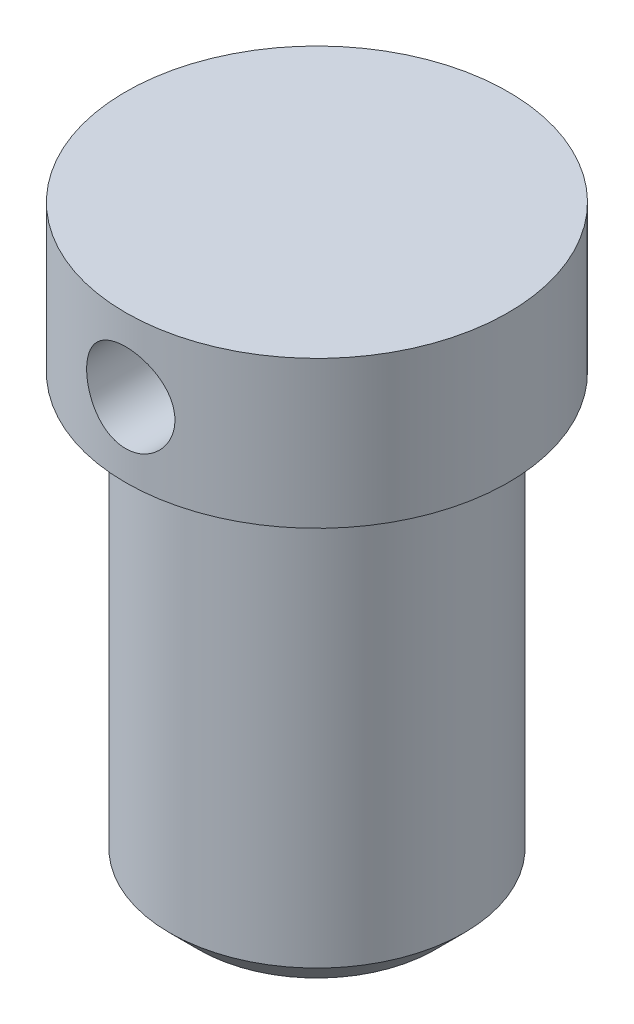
ISO-10303-21;
HEADER;
FILE_DESCRIPTION(('STEP AP214'),'2;1');
FILE_NAME('part.step','',(''),(''),'','','');
FILE_SCHEMA(('AUTOMOTIVE_DESIGN { 1 0 10303 214 1 1 1 1 }'));
ENDSEC;
DATA;
#1=APPLICATION_CONTEXT('core data for automotive mechanical design processes');
#2=APPLICATION_PROTOCOL_DEFINITION('international standard','automotive_design',2000,#1);
#3=PRODUCT_CONTEXT('',#1,'mechanical');
#4=PRODUCT('Part','Part','',(#3));
#5=PRODUCT_RELATED_PRODUCT_CATEGORY('part','',(#4));
#6=PRODUCT_DEFINITION_FORMATION('','',#4);
#7=PRODUCT_DEFINITION_CONTEXT('part definition',#1,'design');
#8=PRODUCT_DEFINITION('design','',#6,#7);
#9=PRODUCT_DEFINITION_SHAPE('','',#8);
#10=(LENGTH_UNIT() NAMED_UNIT(*) SI_UNIT(.MILLI.,.METRE.));
#11=(NAMED_UNIT(*) PLANE_ANGLE_UNIT() SI_UNIT($,.RADIAN.));
#12=(NAMED_UNIT(*) SI_UNIT($,.STERADIAN.) SOLID_ANGLE_UNIT());
#13=UNCERTAINTY_MEASURE_WITH_UNIT(LENGTH_MEASURE(1.E-05),#10,'distance_accuracy_value','');
#14=(GEOMETRIC_REPRESENTATION_CONTEXT(3) GLOBAL_UNCERTAINTY_ASSIGNED_CONTEXT((#13)) GLOBAL_UNIT_ASSIGNED_CONTEXT((#10,
#11,#12)) REPRESENTATION_CONTEXT('',''));
#15=CARTESIAN_POINT('',(0.,0.,0.));
#16=DIRECTION('',(0.,0.,1.));
#17=DIRECTION('',(1.,0.,0.));
#18=AXIS2_PLACEMENT_3D('',#15,#16,#17);
#19=CARTESIAN_POINT('',(0.,20.,0.));
#20=DIRECTION('',(0.,-1.,0.));
#21=DIRECTION('',(0.,0.,-1.));
#22=AXIS2_PLACEMENT_3D('',#19,#20,#21);
#23=CYLINDRICAL_SURFACE('',#22,6.5);
#24=CARTESIAN_POINT('',(0.,20.,0.));
#25=DIRECTION('',(0.,1.,0.));
#26=DIRECTION('',(0.,0.,1.));
#27=AXIS2_PLACEMENT_3D('',#24,#25,#26);
#28=CIRCLE('',#27,6.5);
#29=CARTESIAN_POINT('',(0.,20.,6.5));
#30=VERTEX_POINT('',#29);
#31=EDGE_CURVE('E48',#30,#30,#28,.T.);
#32=ORIENTED_EDGE('',*,*,#31,.F.);
#33=EDGE_LOOP('',(#32));
#34=FACE_BOUND('',#33,.T.);
#35=CARTESIAN_POINT('',(0.,15.,0.));
#36=DIRECTION('',(0.,1.,0.));
#37=DIRECTION('',(0.,0.,1.));
#38=AXIS2_PLACEMENT_3D('',#35,#36,#37);
#39=CIRCLE('',#38,6.5);
#40=CARTESIAN_POINT('',(0.,15.,6.5));
#41=VERTEX_POINT('',#40);
#42=EDGE_CURVE('E58',#41,#41,#39,.T.);
#43=ORIENTED_EDGE('',*,*,#42,.T.);
#44=EDGE_LOOP('',(#43));
#45=FACE_BOUND('',#44,.T.);
#46=CARTESIAN_POINT('',(-1.5,17.5,6.32455532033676));
#47=CARTESIAN_POINT('',(-1.49999731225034,17.4169570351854,6.3245569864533));
#48=CARTESIAN_POINT('',(-1.49308039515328,17.3338827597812,6.32620871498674));
#49=CARTESIAN_POINT('',(-1.46563082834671,17.1701052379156,6.33262329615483));
#50=CARTESIAN_POINT('',(-1.44508905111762,17.0894036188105,6.33738823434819));
#51=CARTESIAN_POINT('',(-1.39107808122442,16.9327640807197,6.34946149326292));
#52=CARTESIAN_POINT('',(-1.3576239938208,16.8568207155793,6.35676684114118));
#53=CARTESIAN_POINT('',(-1.27878238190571,16.7116201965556,6.37309417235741));
#54=CARTESIAN_POINT('',(-1.23339482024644,16.6423630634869,6.3821161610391));
#55=CARTESIAN_POINT('',(-1.13106531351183,16.5111997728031,6.40104967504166));
#56=CARTESIAN_POINT('',(-1.0739411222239,16.4494375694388,6.41097365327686));
#57=CARTESIAN_POINT('',(-0.950153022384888,16.3362808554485,6.43048432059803));
#58=CARTESIAN_POINT('',(-0.883488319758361,16.2848872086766,6.44007098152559));
#59=CARTESIAN_POINT('',(-0.741538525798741,16.1933497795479,6.45796329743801));
#60=CARTESIAN_POINT('',(-0.666161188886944,16.1533455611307,6.46625254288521));
#61=CARTESIAN_POINT('',(-0.509529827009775,16.0866271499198,6.4804748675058));
#62=CARTESIAN_POINT('',(-0.428276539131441,16.0599112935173,6.48640824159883));
#63=CARTESIAN_POINT('',(-0.263698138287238,16.0209838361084,6.49516228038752));
#64=CARTESIAN_POINT('',(-0.180433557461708,16.0085282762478,6.49803523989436));
#65=CARTESIAN_POINT('',(-0.0129504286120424,15.9977111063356,6.50052632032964));
#66=CARTESIAN_POINT('',(0.0712679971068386,15.9993477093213,6.50014485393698));
#67=CARTESIAN_POINT('',(0.236582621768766,16.0164890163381,6.49620964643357));
#68=CARTESIAN_POINT('',(0.317707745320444,16.0317306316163,6.49271608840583));
#69=CARTESIAN_POINT('',(0.476216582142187,16.0752287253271,6.48301834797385));
#70=CARTESIAN_POINT('',(0.553600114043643,16.1034858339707,6.47681403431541));
#71=CARTESIAN_POINT('',(0.703145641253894,16.1724380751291,6.46229685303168));
#72=CARTESIAN_POINT('',(0.775261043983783,16.2132306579,6.45396755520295));
#73=CARTESIAN_POINT('',(0.911717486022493,16.3060227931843,6.43611015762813));
#74=CARTESIAN_POINT('',(0.976057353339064,16.358024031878,6.42658187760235));
#75=CARTESIAN_POINT('',(1.09670294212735,16.4731817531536,6.40711077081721));
#76=CARTESIAN_POINT('',(1.15278844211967,16.5365684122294,6.39716345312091));
#77=CARTESIAN_POINT('',(1.25357772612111,16.671951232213,6.37818005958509));
#78=CARTESIAN_POINT('',(1.29828112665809,16.7439476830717,6.36914401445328));
#79=CARTESIAN_POINT('',(1.375150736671,16.8948902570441,6.35299268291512));
#80=CARTESIAN_POINT('',(1.40727114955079,16.9738605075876,6.34588444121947));
#81=CARTESIAN_POINT('',(1.45771632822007,17.136281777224,6.33448805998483));
#82=CARTESIAN_POINT('',(1.47604355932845,17.2197319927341,6.3301994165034));
#83=CARTESIAN_POINT('',(1.49803182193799,17.3867209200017,6.3250317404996));
#84=CARTESIAN_POINT('',(1.5020153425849,17.4702148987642,6.32407774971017));
#85=CARTESIAN_POINT('',(1.49607984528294,17.636674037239,6.32548450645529));
#86=CARTESIAN_POINT('',(1.48616190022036,17.7196392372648,6.32784499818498));
#87=CARTESIAN_POINT('',(1.45298594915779,17.8815355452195,6.33554357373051));
#88=CARTESIAN_POINT('',(1.42990927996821,17.9605059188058,6.34084115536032));
#89=CARTESIAN_POINT('',(1.37126901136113,18.1134587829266,6.35377976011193));
#90=CARTESIAN_POINT('',(1.33570410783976,18.1874407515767,6.36142102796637));
#91=CARTESIAN_POINT('',(1.25239967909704,18.3297015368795,6.3783481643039));
#92=CARTESIAN_POINT('',(1.20446365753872,18.3978621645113,6.38765975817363));
#93=CARTESIAN_POINT('',(1.09803158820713,18.525290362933,6.40681231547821));
#94=CARTESIAN_POINT('',(1.03953407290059,18.5845566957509,6.41665335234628));
#95=CARTESIAN_POINT('',(0.912172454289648,18.6937858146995,6.43600563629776));
#96=CARTESIAN_POINT('',(0.843116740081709,18.7435275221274,6.44550564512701));
#97=CARTESIAN_POINT('',(0.697443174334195,18.8307054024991,6.46288988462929));
#98=CARTESIAN_POINT('',(0.620825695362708,18.8681421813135,6.47077419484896));
#99=CARTESIAN_POINT('',(0.462705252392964,18.9293497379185,6.48399176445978));
#100=CARTESIAN_POINT('',(0.381239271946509,18.95321220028,6.48934209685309));
#101=CARTESIAN_POINT('',(0.215316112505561,18.9868765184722,6.49696306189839));
#102=CARTESIAN_POINT('',(0.130859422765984,18.9966806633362,6.4992341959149));
#103=CARTESIAN_POINT('',(-0.036557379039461,19.0018374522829,6.50042390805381));
#104=CARTESIAN_POINT('',(-0.119506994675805,18.997518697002,6.49941871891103));
#105=CARTESIAN_POINT('',(-0.283464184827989,18.9752938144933,6.49433417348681));
#106=CARTESIAN_POINT('',(-0.364471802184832,18.957387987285,6.49025488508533));
#107=CARTESIAN_POINT('',(-0.521957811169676,18.9086620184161,6.47948846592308));
#108=CARTESIAN_POINT('',(-0.598452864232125,18.8778932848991,6.47281172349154));
#109=CARTESIAN_POINT('',(-0.745235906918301,18.8043633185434,6.45755951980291));
#110=CARTESIAN_POINT('',(-0.81552322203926,18.7616007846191,6.448983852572));
#111=CARTESIAN_POINT('',(-0.949482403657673,18.6642512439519,6.43064181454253));
#112=CARTESIAN_POINT('',(-1.01298558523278,18.6094360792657,6.42085432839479));
#113=CARTESIAN_POINT('',(-1.13000416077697,18.4899912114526,6.40129818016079));
#114=CARTESIAN_POINT('',(-1.1835171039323,18.4253591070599,6.3915295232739));
#115=CARTESIAN_POINT('',(-1.27982908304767,18.2869280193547,6.37294956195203));
#116=CARTESIAN_POINT('',(-1.32245215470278,18.2130041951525,6.36415514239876));
#117=CARTESIAN_POINT('',(-1.39460165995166,18.0588521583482,6.34873668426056));
#118=CARTESIAN_POINT('',(-1.42413861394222,17.9786290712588,6.34211090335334));
#119=CARTESIAN_POINT('',(-1.46432382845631,17.8320008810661,6.332935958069));
#120=CARTESIAN_POINT('',(-1.47767548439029,17.766359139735,6.32981507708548));
#121=CARTESIAN_POINT('',(-1.49551438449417,17.6338183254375,6.32562414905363));
#122=CARTESIAN_POINT('',(-1.50000216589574,17.5669193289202,6.32455397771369));
#123=CARTESIAN_POINT('',(-1.5,17.5,6.32455532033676));
#124=B_SPLINE_CURVE_WITH_KNOTS('',3,(#46,#47,#48,#49,#50,#51,#52,#53,#54,#55,#56,#57,#58,#59,
#60,#61,#62,#63,#64,#65,#66,#67,#68,#69,#70,#71,#72,#73,#74,#75,#76,#77,#78,#79,#80,#81,#82,#83,
#84,#85,#86,#87,#88,#89,#90,#91,#92,#93,#94,#95,#96,#97,#98,#99,#100,#101,#102,#103,#104,#105,
#106,#107,#108,#109,#110,#111,#112,#113,#114,#115,#116,#117,#118,#119,#120,#121,#122,#123),
.UNSPECIFIED.,.T.,.F.,(4,2,2,2,2,2,2,2,2,2,2,2,2,2,2,2,2,2,2,2,2,2,2,2,2,2,2,2,2,2,2,2,2,2,2,2,
2,2,4),(0.,0.248883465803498,0.497933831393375,0.746693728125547,0.995454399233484,
1.24841764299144,1.50140195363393,1.75736456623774,2.01329512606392,2.26477865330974,
2.5162302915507,2.76292232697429,3.00962630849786,3.25829886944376,3.50700886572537,
3.76147084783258,4.01594140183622,4.27132969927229,4.52667233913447,4.77623696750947,
5.02578233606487,5.27196914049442,5.51818166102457,5.7685754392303,6.01900403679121,
6.27468245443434,6.53034828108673,6.78426611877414,7.03814260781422,7.28615450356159,
7.53416092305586,7.78118549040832,8.02823686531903,8.2804443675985,8.53271366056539,
8.78883275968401,9.04474558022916,9.24531794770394,9.44587815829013),.UNSPECIFIED.);
#125=CARTESIAN_POINT('',(-1.5,17.5,6.32455532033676));
#126=VERTEX_POINT('',#125);
#127=EDGE_CURVE('E59',#126,#126,#124,.T.);
#128=ORIENTED_EDGE('',*,*,#127,.F.);
#129=EDGE_LOOP('',(#128));
#130=FACE_BOUND('',#129,.T.);
#131=CARTESIAN_POINT('',(0.,19.,-6.5));
#132=CARTESIAN_POINT('',(0.0830761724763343,18.9999973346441,-6.49999849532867));
#133=CARTESIAN_POINT('',(0.166183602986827,18.9930750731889,-6.49839124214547));
#134=CARTESIAN_POINT('',(0.330029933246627,18.9656023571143,-6.49213500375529));
#135=CARTESIAN_POINT('',(0.410767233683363,18.9450429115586,-6.48748401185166));
#136=CARTESIAN_POINT('',(0.567482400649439,18.8909803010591,-6.47565710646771));
#137=CARTESIAN_POINT('',(0.643465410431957,18.8574914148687,-6.46848397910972));
#138=CARTESIAN_POINT('',(0.788732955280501,18.7785677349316,-6.45238316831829));
#139=CARTESIAN_POINT('',(0.858017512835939,18.7331329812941,-6.44345549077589));
#140=CARTESIAN_POINT('',(0.989152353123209,18.6307547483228,-6.42464323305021));
#141=CARTESIAN_POINT('',(1.05086679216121,18.5736396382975,-6.41474568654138));
#142=CARTESIAN_POINT('',(1.16393060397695,18.4498900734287,-6.39519859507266));
#143=CARTESIAN_POINT('',(1.2152789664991,18.3832546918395,-6.38554907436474));
#144=CARTESIAN_POINT('',(1.3067669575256,18.2413330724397,-6.36746174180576));
#145=CARTESIAN_POINT('',(1.34675925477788,18.1659495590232,-6.35904049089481));
#146=CARTESIAN_POINT('',(1.41345395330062,18.0093049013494,-6.34455046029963));
#147=CARTESIAN_POINT('',(1.44015813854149,17.9280445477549,-6.33848136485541));
#148=CARTESIAN_POINT('',(1.4790642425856,17.7634341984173,-6.32951534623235));
#149=CARTESIAN_POINT('',(1.4915080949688,17.6801443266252,-6.32656557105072));
#150=CARTESIAN_POINT('',(1.50229307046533,17.5126109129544,-6.32401364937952));
#151=CARTESIAN_POINT('',(1.50063613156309,17.4283675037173,-6.32441104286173));
#152=CARTESIAN_POINT('',(1.48346063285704,17.2631371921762,-6.32846083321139));
#153=CARTESIAN_POINT('',(1.46822575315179,17.1821189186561,-6.33204661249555));
#154=CARTESIAN_POINT('',(1.42477741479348,17.0238202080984,-6.34196351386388));
#155=CARTESIAN_POINT('',(1.39656315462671,16.9465400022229,-6.34829480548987));
#156=CARTESIAN_POINT('',(1.32770349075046,16.7971273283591,-6.36305332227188));
#157=CARTESIAN_POINT('',(1.28695129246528,16.725045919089,-6.37149843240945));
#158=CARTESIAN_POINT('',(1.19424748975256,16.5886407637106,-6.38952239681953));
#159=CARTESIAN_POINT('',(1.14229419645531,16.524318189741,-6.39910142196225));
#160=CARTESIAN_POINT('',(1.02717321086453,16.403626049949,-6.41859777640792));
#161=CARTESIAN_POINT('',(0.963764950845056,16.347486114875,-6.42851768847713));
#162=CARTESIAN_POINT('',(0.828318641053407,16.2465969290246,-6.44736816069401));
#163=CARTESIAN_POINT('',(0.756280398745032,16.2018479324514,-6.45629869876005));
#164=CARTESIAN_POINT('',(0.605321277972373,16.1249440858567,-6.47219854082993));
#165=CARTESIAN_POINT('',(0.52638314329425,16.0928219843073,-6.47916273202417));
#166=CARTESIAN_POINT('',(0.364032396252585,16.0423638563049,-6.49030757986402));
#167=CARTESIAN_POINT('',(0.28062051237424,16.0240255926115,-6.49448868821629));
#168=CARTESIAN_POINT('',(0.113657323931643,16.0019958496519,-6.49953102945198));
#169=CARTESIAN_POINT('',(0.030149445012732,15.9979910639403,-6.50046326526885));
#170=CARTESIAN_POINT('',(-0.136342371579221,16.0038890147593,-6.49910299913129));
#171=CARTESIAN_POINT('',(-0.219326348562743,16.013790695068,-6.49681074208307));
#172=CARTESIAN_POINT('',(-0.381357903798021,16.0469611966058,-6.48930412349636));
#173=CARTESIAN_POINT('',(-0.460441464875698,16.0700632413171,-6.48412623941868));
#174=CARTESIAN_POINT('',(-0.613609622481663,16.1287915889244,-6.47142910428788));
#175=CARTESIAN_POINT('',(-0.687693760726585,16.1644190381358,-6.4639096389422));
#176=CARTESIAN_POINT('',(-0.830037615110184,16.247822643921,-6.44718996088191));
#177=CARTESIAN_POINT('',(-0.898188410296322,16.2957796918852,-6.43796535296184));
#178=CARTESIAN_POINT('',(-1.02558718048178,16.4022456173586,-6.41890391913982));
#179=CARTESIAN_POINT('',(-1.08483385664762,16.4607560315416,-6.40906700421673));
#180=CARTESIAN_POINT('',(-1.19400102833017,16.588112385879,-6.38964047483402));
#181=CARTESIAN_POINT('',(-1.24370343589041,16.6571469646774,-6.3800601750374));
#182=CARTESIAN_POINT('',(-1.33081235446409,16.8027658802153,-6.36246188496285));
#183=CARTESIAN_POINT('',(-1.3682194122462,16.8793498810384,-6.35444382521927));
#184=CARTESIAN_POINT('',(-1.42941066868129,17.0374759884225,-6.34095951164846));
#185=CARTESIAN_POINT('',(-1.45327404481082,17.1189861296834,-6.33547846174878));
#186=CARTESIAN_POINT('',(-1.48692530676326,17.2850039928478,-6.3276660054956));
#187=CARTESIAN_POINT('',(-1.49671574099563,17.36951116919,-6.32533402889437));
#188=CARTESIAN_POINT('',(-1.50182536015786,17.5369182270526,-6.32412253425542));
#189=CARTESIAN_POINT('',(-1.49749127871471,17.6198071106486,-6.32516029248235));
#190=CARTESIAN_POINT('',(-1.47525685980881,17.7836386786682,-6.33038270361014));
#191=CARTESIAN_POINT('',(-1.45735672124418,17.8645813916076,-6.33456731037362));
#192=CARTESIAN_POINT('',(-1.40867420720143,18.0219099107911,-6.34556939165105));
#193=CARTESIAN_POINT('',(-1.37794771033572,18.0983138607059,-6.35237543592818));
#194=CARTESIAN_POINT('',(-1.304530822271,18.2449318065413,-6.36785683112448));
#195=CARTESIAN_POINT('',(-1.26183902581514,18.3151450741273,-6.37653240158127));
#196=CARTESIAN_POINT('',(-1.16457679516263,18.4490855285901,-6.39501829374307));
#197=CARTESIAN_POINT('',(-1.10976162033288,18.5126321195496,-6.4048496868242));
#198=CARTESIAN_POINT('',(-0.990297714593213,18.6297382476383,-6.42440402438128));
#199=CARTESIAN_POINT('',(-0.925646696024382,18.6832954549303,-6.43412694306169));
#200=CARTESIAN_POINT('',(-0.787191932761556,18.7796672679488,-6.45253999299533));
#201=CARTESIAN_POINT('',(-0.713266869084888,18.8223111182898,-6.46121270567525));
#202=CARTESIAN_POINT('',(-0.559109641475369,18.8944991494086,-6.47637045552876));
#203=CARTESIAN_POINT('',(-0.478882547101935,18.9240537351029,-6.48285722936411));
#204=CARTESIAN_POINT('',(-0.332210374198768,18.9642784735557,-6.49182723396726));
#205=CARTESIAN_POINT('',(-0.266526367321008,18.977647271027,-6.49487228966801));
#206=CARTESIAN_POINT('',(-0.133901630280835,18.9955088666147,-6.4989592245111));
#207=CARTESIAN_POINT('',(-0.0669609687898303,19.0000021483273,-6.5000012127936));
#208=CARTESIAN_POINT('',(0.,19.,-6.5));
#209=B_SPLINE_CURVE_WITH_KNOTS('',3,(#131,#132,#133,#134,#135,#136,#137,#138,#139,#140,#141,
#142,#143,#144,#145,#146,#147,#148,#149,#150,#151,#152,#153,#154,#155,#156,#157,#158,#159,#160,
#161,#162,#163,#164,#165,#166,#167,#168,#169,#170,#171,#172,#173,#174,#175,#176,#177,#178,#179,
#180,#181,#182,#183,#184,#185,#186,#187,#188,#189,#190,#191,#192,#193,#194,#195,#196,#197,#198,
#199,#200,#201,#202,#203,#204,#205,#206,#207,#208),.UNSPECIFIED.,.T.,.F.,(4,2,2,2,2,2,2,2,2,2,2,
2,2,2,2,2,2,2,2,2,2,2,2,2,2,2,2,2,2,2,2,2,2,2,2,2,2,2,4),(0.,0.248983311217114,
0.498130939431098,0.747004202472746,0.995876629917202,1.24870930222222,1.50156660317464,
1.75756840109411,2.0135358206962,2.26509316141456,2.51661592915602,2.76300377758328,
3.00940684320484,3.25796969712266,3.50657005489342,3.76117526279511,4.01578615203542,
4.27105309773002,4.52627860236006,4.77589001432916,5.02548246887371,5.27198911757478,
5.51851833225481,5.76889433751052,6.01930682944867,6.27489540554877,6.53047261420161,
6.7845398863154,7.03856114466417,7.28639401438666,7.53422325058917,7.78098389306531,
8.02777352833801,8.28009323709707,8.53247172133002,8.78858609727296,9.04449651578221,
9.24519271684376,9.44587798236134),.UNSPECIFIED.);
#210=CARTESIAN_POINT('',(0.,19.,-6.5));
#211=VERTEX_POINT('',#210);
#212=EDGE_CURVE('E51',#211,#211,#209,.T.);
#213=ORIENTED_EDGE('',*,*,#212,.F.);
#214=EDGE_LOOP('',(#213));
#215=FACE_BOUND('',#214,.T.);
#216=ADVANCED_FACE('F33',(#34,#45,#130,#215),#23,.T.);
#217=CARTESIAN_POINT('',(0.,15.,0.));
#218=DIRECTION('',(0.,-1.,0.));
#219=DIRECTION('',(0.,0.,-1.));
#220=AXIS2_PLACEMENT_3D('',#217,#218,#219);
#221=CYLINDRICAL_SURFACE('',#220,5.);
#222=CARTESIAN_POINT('',(0.,1.,0.));
#223=DIRECTION('',(0.,1.,0.));
#224=DIRECTION('',(0.,0.,1.));
#225=AXIS2_PLACEMENT_3D('',#222,#223,#224);
#226=CIRCLE('',#225,5.);
#227=CARTESIAN_POINT('',(0.,1.,5.));
#228=VERTEX_POINT('',#227);
#229=EDGE_CURVE('E40',#228,#228,#226,.T.);
#230=ORIENTED_EDGE('',*,*,#229,.T.);
#231=EDGE_LOOP('',(#230));
#232=FACE_BOUND('',#231,.T.);
#233=CARTESIAN_POINT('',(0.,15.,0.));
#234=DIRECTION('',(0.,1.,0.));
#235=DIRECTION('',(0.,0.,1.));
#236=AXIS2_PLACEMENT_3D('',#233,#234,#235);
#237=CIRCLE('',#236,5.);
#238=CARTESIAN_POINT('',(0.,15.,5.));
#239=VERTEX_POINT('',#238);
#240=EDGE_CURVE('E44',#239,#239,#237,.T.);
#241=ORIENTED_EDGE('',*,*,#240,.F.);
#242=EDGE_LOOP('',(#241));
#243=FACE_BOUND('',#242,.T.);
#244=ADVANCED_FACE('F82',(#232,#243),#221,.T.);
#245=CARTESIAN_POINT('',(0.,0.,0.));
#246=DIRECTION('',(0.,1.,0.));
#247=DIRECTION('',(0.,0.,1.));
#248=AXIS2_PLACEMENT_3D('',#245,#246,#247);
#249=PLANE('',#248);
#250=CARTESIAN_POINT('',(0.,0.,0.));
#251=DIRECTION('',(0.,1.,0.));
#252=DIRECTION('',(0.,0.,1.));
#253=AXIS2_PLACEMENT_3D('',#250,#251,#252);
#254=CIRCLE('',#253,3.99999999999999);
#255=CARTESIAN_POINT('',(0.,0.,3.99999999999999));
#256=VERTEX_POINT('',#255);
#257=EDGE_CURVE('E10',#256,#256,#254,.F.);
#258=ORIENTED_EDGE('',*,*,#257,.T.);
#259=EDGE_LOOP('',(#258));
#260=FACE_BOUND('',#259,.T.);
#261=ADVANCED_FACE('F74',(#260),#249,.F.);
#262=CARTESIAN_POINT('',(0.,20.,0.));
#263=DIRECTION('',(0.,1.,0.));
#264=DIRECTION('',(0.,0.,1.));
#265=AXIS2_PLACEMENT_3D('',#262,#263,#264);
#266=PLANE('',#265);
#267=ORIENTED_EDGE('',*,*,#31,.T.);
#268=EDGE_LOOP('',(#267));
#269=FACE_BOUND('',#268,.T.);
#270=ADVANCED_FACE('F71',(#269),#266,.T.);
#271=CARTESIAN_POINT('',(0.,15.,0.));
#272=DIRECTION('',(0.,1.,0.));
#273=DIRECTION('',(0.,0.,1.));
#274=AXIS2_PLACEMENT_3D('',#271,#272,#273);
#275=PLANE('',#274);
#276=ORIENTED_EDGE('',*,*,#240,.T.);
#277=EDGE_LOOP('',(#276));
#278=FACE_BOUND('',#277,.T.);
#279=ORIENTED_EDGE('',*,*,#42,.F.);
#280=EDGE_LOOP('',(#279));
#281=FACE_BOUND('',#280,.T.);
#282=ADVANCED_FACE('F69',(#278,#281),#275,.F.);
#283=CARTESIAN_POINT('',(0.,17.5,10.));
#284=DIRECTION('',(0.,0.,-1.));
#285=DIRECTION('',(-1.,0.,0.));
#286=AXIS2_PLACEMENT_3D('',#283,#284,#285);
#287=CYLINDRICAL_SURFACE('',#286,1.5);
#288=ORIENTED_EDGE('',*,*,#127,.T.);
#289=EDGE_LOOP('',(#288));
#290=FACE_BOUND('',#289,.T.);
#291=ORIENTED_EDGE('',*,*,#212,.T.);
#292=EDGE_LOOP('',(#291));
#293=FACE_BOUND('',#292,.T.);
#294=ADVANCED_FACE('F65',(#290,#293),#287,.F.);
#295=CARTESIAN_POINT('',(0.,1.,0.));
#296=DIRECTION('',(0.,1.,0.));
#297=DIRECTION('',(0.,0.,1.));
#298=AXIS2_PLACEMENT_3D('',#295,#296,#297);
#299=CONICAL_SURFACE('',#298,5.,0.78539816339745);
#300=ORIENTED_EDGE('',*,*,#257,.F.);
#301=EDGE_LOOP('',(#300));
#302=FACE_BOUND('',#301,.T.);
#303=ORIENTED_EDGE('',*,*,#229,.F.);
#304=EDGE_LOOP('',(#303));
#305=FACE_BOUND('',#304,.T.);
#306=ADVANCED_FACE('F35',(#302,#305),#299,.T.);
#307=CLOSED_SHELL('',(#216,#244,#261,#270,#282,#294,#306));
#308=MANIFOLD_SOLID_BREP('B2',#307);
#309=ADVANCED_BREP_SHAPE_REPRESENTATION('',(#18,#308),#14);
#310=SHAPE_DEFINITION_REPRESENTATION(#9,#309);
ENDSEC;
END-ISO-10303-21;
